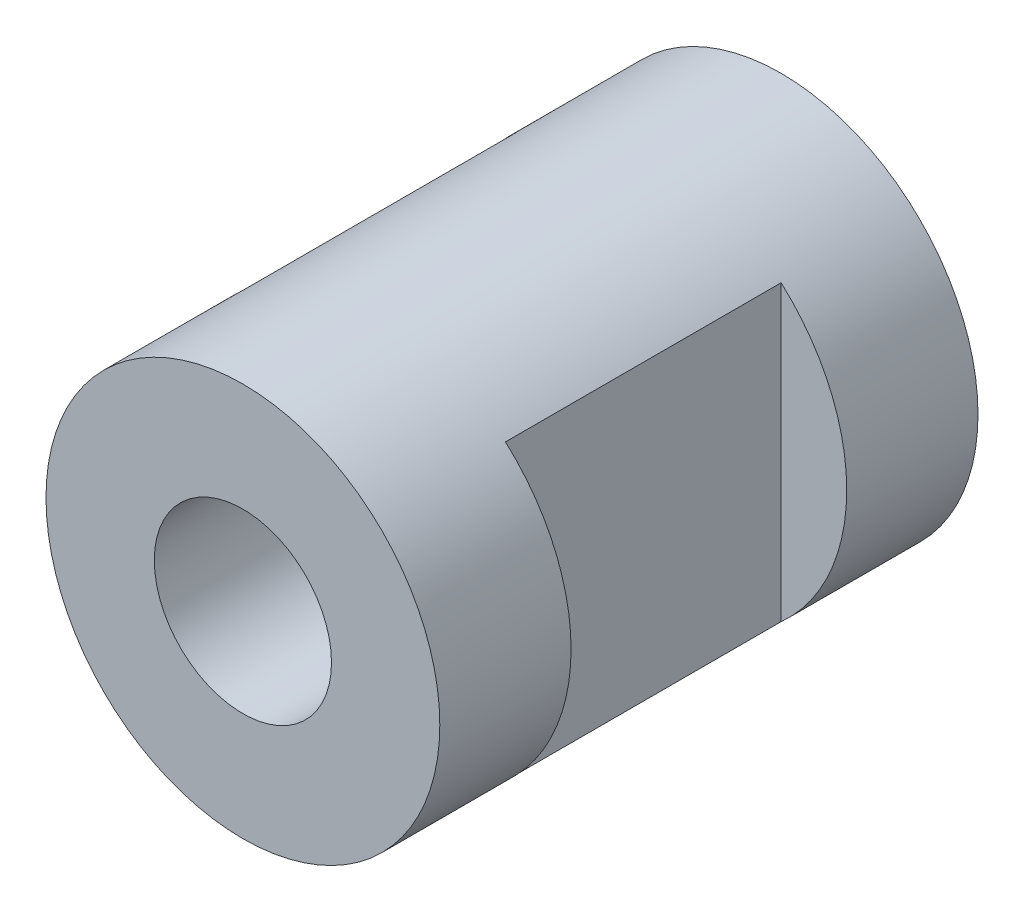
from build123d import *

# Parameters (mm, degrees)
SKETCH_1_R          = 7.5
SKETCH_1_R_2        = 3.375
EXTRUDE_1_DEPTH     = 20.5
SKETCH_4_W          = 3.599566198
SKETCH_4_H          = 10.5
CUT_EXTRUDE_1_DEPTH = 20.5


with BuildPart() as part:
    # Sketch 1 → Extrude 1 (new body)
    with BuildSketch(Plane.XY):
        Circle(SKETCH_1_R)
        Circle(SKETCH_1_R_2, mode=Mode.SUBTRACT)
    extrude(amount=EXTRUDE_1_DEPTH)

    # Sketch 4 → Cut-Extrude 1 (cut)
    with BuildSketch(Plane(origin=(0, 7.5, 0), x_dir=(-1, 0, 0), z_dir=(0, 1, 0))):
        with Locations((-6.799783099, 10.25)):
            Rectangle(SKETCH_4_W, SKETCH_4_H)
        with Locations((6.799783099, 10.25)):
            Rectangle(SKETCH_4_W, SKETCH_4_H)
    extrude(amount=-CUT_EXTRUDE_1_DEPTH, mode=Mode.SUBTRACT)


solid = part.part
